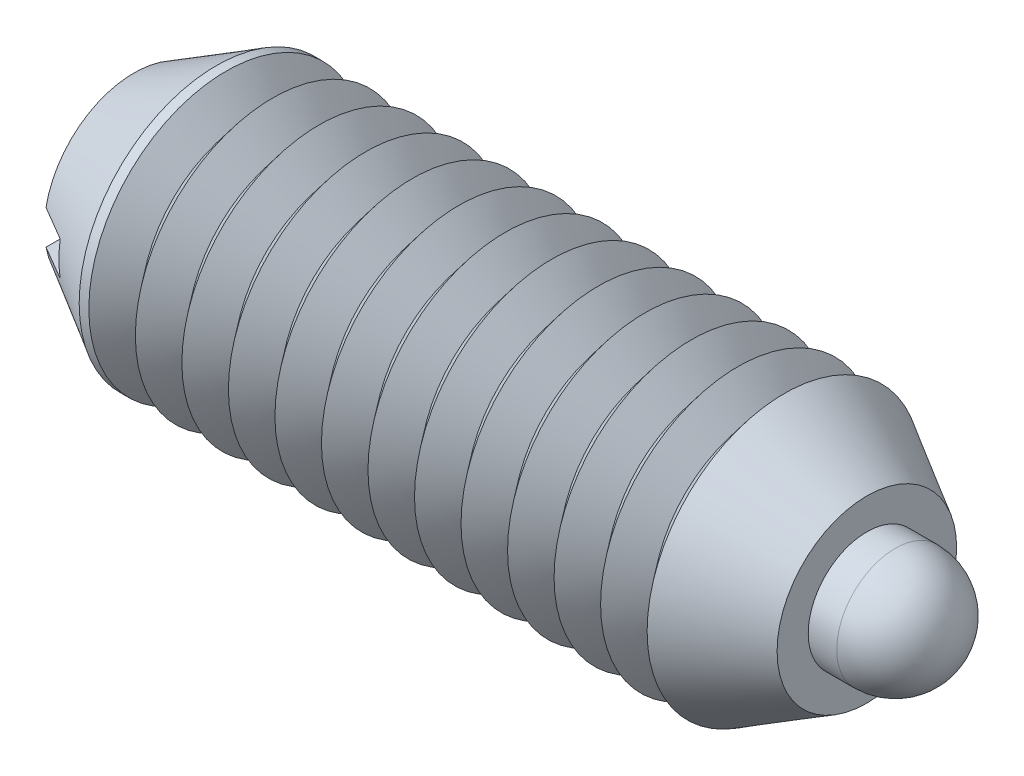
ISO-10303-21;
HEADER;
FILE_DESCRIPTION(('STEP AP214'),'2;1');
FILE_NAME('part.step','',(''),(''),'','','');
FILE_SCHEMA(('AUTOMOTIVE_DESIGN { 1 0 10303 214 1 1 1 1 }'));
ENDSEC;
DATA;
#1=APPLICATION_CONTEXT('core data for automotive mechanical design processes');
#2=APPLICATION_PROTOCOL_DEFINITION('international standard','automotive_design',2000,#1);
#3=PRODUCT_CONTEXT('',#1,'mechanical');
#4=PRODUCT('Part','Part','',(#3));
#5=PRODUCT_RELATED_PRODUCT_CATEGORY('part','',(#4));
#6=PRODUCT_DEFINITION_FORMATION('','',#4);
#7=PRODUCT_DEFINITION_CONTEXT('part definition',#1,'design');
#8=PRODUCT_DEFINITION('design','',#6,#7);
#9=PRODUCT_DEFINITION_SHAPE('','',#8);
#10=(LENGTH_UNIT() NAMED_UNIT(*) SI_UNIT(.MILLI.,.METRE.));
#11=(NAMED_UNIT(*) PLANE_ANGLE_UNIT() SI_UNIT($,.RADIAN.));
#12=(NAMED_UNIT(*) SI_UNIT($,.STERADIAN.) SOLID_ANGLE_UNIT());
#13=UNCERTAINTY_MEASURE_WITH_UNIT(LENGTH_MEASURE(1.E-05),#10,'distance_accuracy_value','');
#14=(GEOMETRIC_REPRESENTATION_CONTEXT(3) GLOBAL_UNCERTAINTY_ASSIGNED_CONTEXT((#13)) GLOBAL_UNIT_ASSIGNED_CONTEXT((#10,
#11,#12)) REPRESENTATION_CONTEXT('',''));
#15=CARTESIAN_POINT('',(0.,0.,0.));
#16=DIRECTION('',(0.,0.,1.));
#17=DIRECTION('',(1.,0.,0.));
#18=AXIS2_PLACEMENT_3D('',#15,#16,#17);
#19=CARTESIAN_POINT('',(9.0678,0.,0.));
#20=DIRECTION('',(-1.,0.,0.));
#21=DIRECTION('',(0.,-0.719424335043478,-0.694570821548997));
#22=AXIS2_PLACEMENT_3D('',#19,#20,#21);
#23=PLANE('',#22);
#24=CARTESIAN_POINT('',(9.0678,0.,0.));
#25=DIRECTION('',(1.,0.,0.));
#26=DIRECTION('',(0.,0.719424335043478,0.694570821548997));
#27=AXIS2_PLACEMENT_3D('',#24,#25,#26);
#28=CIRCLE('',#27,0.889);
#29=CARTESIAN_POINT('',(9.0678,0.639568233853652,0.617473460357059));
#30=VERTEX_POINT('',#29);
#31=EDGE_CURVE('P0_E10',#30,#30,#28,.T.);
#32=ORIENTED_EDGE('',*,*,#31,.F.);
#33=EDGE_LOOP('',(#32));
#34=FACE_BOUND('',#33,.T.);
#35=ADVANCED_FACE('P0_F14',(#34),#23,.T.);
#36=CARTESIAN_POINT('',(9.2456,0.,0.));
#37=DIRECTION('',(1.,0.,0.));
#38=DIRECTION('',(0.,0.719424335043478,0.694570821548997));
#39=AXIS2_PLACEMENT_3D('',#36,#37,#38);
#40=CONICAL_SURFACE('',#39,1.0668,0.78539816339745);
#41=ORIENTED_EDGE('',*,*,#31,.T.);
#42=EDGE_LOOP('',(#41));
#43=FACE_BOUND('',#42,.T.);
#44=CARTESIAN_POINT('',(9.2456,0.,0.));
#45=DIRECTION('',(1.,0.,0.));
#46=DIRECTION('',(0.,0.719424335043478,0.694570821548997));
#47=AXIS2_PLACEMENT_3D('',#44,#45,#46);
#48=CIRCLE('',#47,1.0668);
#49=CARTESIAN_POINT('',(9.2456,0.767481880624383,0.740968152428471));
#50=VERTEX_POINT('',#49);
#51=EDGE_CURVE('P0_E20',#50,#50,#48,.T.);
#52=ORIENTED_EDGE('',*,*,#51,.F.);
#53=EDGE_LOOP('',(#52));
#54=FACE_BOUND('',#53,.T.);
#55=ADVANCED_FACE('P0_F54',(#43,#54),#40,.T.);
#56=CARTESIAN_POINT('',(12.4333,0.,0.));
#57=DIRECTION('',(1.,0.,0.));
#58=DIRECTION('',(0.,0.719424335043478,0.694570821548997));
#59=AXIS2_PLACEMENT_3D('',#56,#57,#58);
#60=CYLINDRICAL_SURFACE('',#59,1.0668);
#61=ORIENTED_EDGE('',*,*,#51,.T.);
#62=EDGE_LOOP('',(#61));
#63=FACE_BOUND('',#62,.T.);
#64=CARTESIAN_POINT('',(10.5378413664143,0.,0.));
#65=DIRECTION('',(1.,0.,0.));
#66=DIRECTION('',(0.,0.719424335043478,0.694570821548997));
#67=AXIS2_PLACEMENT_3D('',#64,#65,#66);
#68=CIRCLE('',#67,1.0668);
#69=CARTESIAN_POINT('',(10.5378413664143,0.767481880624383,0.74096815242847));
#70=VERTEX_POINT('',#69);
#71=EDGE_CURVE('P0_E24',#70,#70,#68,.T.);
#72=ORIENTED_EDGE('',*,*,#71,.F.);
#73=EDGE_LOOP('',(#72));
#74=FACE_BOUND('',#73,.T.);
#75=ADVANCED_FACE('P0_F50',(#63,#74),#60,.T.);
#76=CARTESIAN_POINT('',(10.8458,0.,0.));
#77=DIRECTION('',(-1.,0.,0.));
#78=DIRECTION('',(0.,-0.719424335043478,-0.694570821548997));
#79=AXIS2_PLACEMENT_3D('',#76,#77,#78);
#80=CONICAL_SURFACE('',#79,0.889,0.523598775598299);
#81=ORIENTED_EDGE('',*,*,#71,.T.);
#82=EDGE_LOOP('',(#81));
#83=FACE_BOUND('',#82,.T.);
#84=CARTESIAN_POINT('',(10.8458,0.,0.));
#85=DIRECTION('',(1.,0.,0.));
#86=DIRECTION('',(0.,0.719424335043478,0.694570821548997));
#87=AXIS2_PLACEMENT_3D('',#84,#85,#86);
#88=CIRCLE('',#87,0.889);
#89=CARTESIAN_POINT('',(10.8458,0.639568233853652,0.617473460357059));
#90=VERTEX_POINT('',#89);
#91=EDGE_CURVE('P0_E28',#90,#90,#88,.T.);
#92=ORIENTED_EDGE('',*,*,#91,.F.);
#93=EDGE_LOOP('',(#92));
#94=FACE_BOUND('',#93,.T.);
#95=ADVANCED_FACE('P0_F41',(#83,#94),#80,.T.);
#96=CARTESIAN_POINT('',(12.4333,0.,0.));
#97=DIRECTION('',(1.,0.,0.));
#98=DIRECTION('',(0.,0.719424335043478,0.694570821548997));
#99=AXIS2_PLACEMENT_3D('',#96,#97,#98);
#100=CYLINDRICAL_SURFACE('',#99,0.889);
#101=ORIENTED_EDGE('',*,*,#91,.T.);
#102=EDGE_LOOP('',(#101));
#103=FACE_BOUND('',#102,.T.);
#104=CARTESIAN_POINT('',(11.5443,0.,0.));
#105=DIRECTION('',(1.,0.,0.));
#106=DIRECTION('',(0.,0.719424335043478,0.694570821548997));
#107=AXIS2_PLACEMENT_3D('',#104,#105,#106);
#108=CIRCLE('',#107,0.889);
#109=CARTESIAN_POINT('',(11.5443,0.639568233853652,0.617473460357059));
#110=VERTEX_POINT('',#109);
#111=EDGE_CURVE('P0_E33',#110,#110,#108,.T.);
#112=ORIENTED_EDGE('',*,*,#111,.F.);
#113=EDGE_LOOP('',(#112));
#114=FACE_BOUND('',#113,.T.);
#115=ADVANCED_FACE('P0_F39',(#103,#114),#100,.T.);
#116=CARTESIAN_POINT('',(11.5443,0.,0.));
#117=DIRECTION('',(1.,0.,0.));
#118=DIRECTION('',(0.,-0.719424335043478,-0.694570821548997));
#119=AXIS2_PLACEMENT_3D('',#116,#117,#118);
#120=SPHERICAL_SURFACE('',#119,0.889);
#121=ORIENTED_EDGE('',*,*,#111,.T.);
#122=EDGE_LOOP('',(#121));
#123=FACE_BOUND('',#122,.T.);
#124=ADVANCED_FACE('P0_F37',(#123),#120,.T.);
#125=CLOSED_SHELL('',(#35,#55,#75,#95,#115,#124));
#126=MANIFOLD_SOLID_BREP('P0_B1',#125);
#127=CARTESIAN_POINT('',(11.1125,0.,0.));
#128=DIRECTION('',(1.,0.,0.));
#129=DIRECTION('',(0.,0.,-1.));
#130=AXIS2_PLACEMENT_3D('',#127,#128,#129);
#131=PLANE('',#130);
#132=CARTESIAN_POINT('',(11.1125,0.,0.));
#133=DIRECTION('',(1.,0.,0.));
#134=DIRECTION('',(0.,0.,-1.));
#135=AXIS2_PLACEMENT_3D('',#132,#133,#134);
#136=CIRCLE('',#135,1.36129691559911);
#137=CARTESIAN_POINT('',(11.1125,0.,-1.36129691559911));
#138=VERTEX_POINT('',#137);
#139=EDGE_CURVE('P1_E81',#138,#138,#136,.T.);
#140=ORIENTED_EDGE('',*,*,#139,.T.);
#141=EDGE_LOOP('',(#140));
#142=FACE_BOUND('',#141,.T.);
#143=CARTESIAN_POINT('',(11.1125,0.,0.));
#144=DIRECTION('',(-1.,0.,0.));
#145=DIRECTION('',(0.,0.,1.));
#146=AXIS2_PLACEMENT_3D('',#143,#144,#145);
#147=CIRCLE('',#146,0.889);
#148=CARTESIAN_POINT('',(11.1125,0.,0.889));
#149=VERTEX_POINT('',#148);
#150=EDGE_CURVE('P1_E68',#149,#149,#147,.T.);
#151=ORIENTED_EDGE('',*,*,#150,.T.);
#152=EDGE_LOOP('',(#151));
#153=FACE_BOUND('',#152,.T.);
#154=ADVANCED_FACE('P1_F15',(#142,#153),#131,.T.);
#155=CARTESIAN_POINT('',(11.1125,0.,0.));
#156=DIRECTION('',(-1.,0.,0.));
#157=DIRECTION('',(0.,0.,1.));
#158=AXIS2_PLACEMENT_3D('',#155,#156,#157);
#159=CONICAL_SURFACE('',#158,1.36129691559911,0.523598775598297);
#160=CARTESIAN_POINT('',(9.86281999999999,0.,0.));
#161=DIRECTION('',(-1.,0.,0.));
#162=DIRECTION('',(0.,0.,1.));
#163=AXIS2_PLACEMENT_3D('',#160,#161,#162);
#164=CIRCLE('',#163,2.0828);
#165=CARTESIAN_POINT('',(9.86281999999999,0.,2.0828));
#166=VERTEX_POINT('',#165);
#167=EDGE_CURVE('P1_E193',#166,#166,#164,.T.);
#168=ORIENTED_EDGE('',*,*,#167,.F.);
#169=EDGE_LOOP('',(#168));
#170=FACE_BOUND('',#169,.T.);
#171=ORIENTED_EDGE('',*,*,#139,.F.);
#172=EDGE_LOOP('',(#171));
#173=FACE_BOUND('',#172,.T.);
#174=ADVANCED_FACE('P1_F17',(#170,#173),#159,.T.);
#175=CARTESIAN_POINT('',(0.,0.,0.));
#176=DIRECTION('',(-1.,0.,0.));
#177=DIRECTION('',(0.,0.,1.));
#178=AXIS2_PLACEMENT_3D('',#175,#176,#177);
#179=CYLINDRICAL_SURFACE('',#178,0.889);
#180=CARTESIAN_POINT('',(10.8458,0.,0.));
#181=DIRECTION('',(-1.,0.,0.));
#182=DIRECTION('',(0.,0.,1.));
#183=AXIS2_PLACEMENT_3D('',#180,#181,#182);
#184=CIRCLE('',#183,0.889);
#185=CARTESIAN_POINT('',(10.8458,0.,0.889));
#186=VERTEX_POINT('',#185);
#187=EDGE_CURVE('P1_E205',#186,#186,#184,.T.);
#188=ORIENTED_EDGE('',*,*,#187,.T.);
#189=EDGE_LOOP('',(#188));
#190=FACE_BOUND('',#189,.T.);
#191=ORIENTED_EDGE('',*,*,#150,.F.);
#192=EDGE_LOOP('',(#191));
#193=FACE_BOUND('',#192,.T.);
#194=ADVANCED_FACE('P1_F530',(#190,#193),#179,.F.);
#195=CARTESIAN_POINT('',(10.8458,0.,0.));
#196=DIRECTION('',(-1.,0.,0.));
#197=DIRECTION('',(0.,0.,1.));
#198=AXIS2_PLACEMENT_3D('',#195,#196,#197);
#199=CONICAL_SURFACE('',#198,0.889,0.78539816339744);
#200=CARTESIAN_POINT('',(10.668,0.,0.));
#201=DIRECTION('',(-1.,0.,0.));
#202=DIRECTION('',(0.,0.,1.));
#203=AXIS2_PLACEMENT_3D('',#200,#201,#202);
#204=CIRCLE('',#203,1.0668);
#205=CARTESIAN_POINT('',(10.668,0.,1.0668));
#206=VERTEX_POINT('',#205);
#207=EDGE_CURVE('P1_E202',#206,#206,#204,.T.);
#208=ORIENTED_EDGE('',*,*,#207,.T.);
#209=EDGE_LOOP('',(#208));
#210=FACE_BOUND('',#209,.T.);
#211=ORIENTED_EDGE('',*,*,#187,.F.);
#212=EDGE_LOOP('',(#211));
#213=FACE_BOUND('',#212,.T.);
#214=ADVANCED_FACE('P1_F520',(#210,#213),#199,.F.);
#215=CARTESIAN_POINT('',(0.,0.,0.));
#216=DIRECTION('',(-1.,0.,0.));
#217=DIRECTION('',(0.,0.,1.));
#218=AXIS2_PLACEMENT_3D('',#215,#216,#217);
#219=CYLINDRICAL_SURFACE('',#218,1.0668);
#220=CARTESIAN_POINT('',(1.5621,0.,0.));
#221=DIRECTION('',(-1.,0.,0.));
#222=DIRECTION('',(0.,0.,1.));
#223=AXIS2_PLACEMENT_3D('',#220,#221,#222);
#224=CIRCLE('',#223,1.0668);
#225=CARTESIAN_POINT('',(1.5621,0.,1.0668));
#226=VERTEX_POINT('',#225);
#227=EDGE_CURVE('P1_E199',#226,#226,#224,.T.);
#228=ORIENTED_EDGE('',*,*,#227,.T.);
#229=EDGE_LOOP('',(#228));
#230=FACE_BOUND('',#229,.T.);
#231=ORIENTED_EDGE('',*,*,#207,.F.);
#232=EDGE_LOOP('',(#231));
#233=FACE_BOUND('',#232,.T.);
#234=ADVANCED_FACE('P1_F510',(#230,#233),#219,.F.);
#235=CARTESIAN_POINT('',(1.5621,0.,0.));
#236=DIRECTION('',(1.,0.,0.));
#237=DIRECTION('',(0.,0.,-1.));
#238=AXIS2_PLACEMENT_3D('',#235,#236,#237);
#239=PLANE('',#238);
#240=ORIENTED_EDGE('',*,*,#227,.F.);
#241=EDGE_LOOP('',(#240));
#242=FACE_BOUND('',#241,.T.);
#243=ADVANCED_FACE('P1_F500',(#242),#239,.T.);
#244=CARTESIAN_POINT('',(9.51004222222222,0.,0.));
#245=DIRECTION('',(1.,0.,0.));
#246=DIRECTION('',(0.,0.,-1.));
#247=AXIS2_PLACEMENT_3D('',#244,#245,#246);
#248=CONICAL_SURFACE('',#247,1.64218069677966,0.895664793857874);
#249=ORIENTED_EDGE('',*,*,#167,.T.);
#250=EDGE_LOOP('',(#249));
#251=FACE_BOUND('',#250,.T.);
#252=CARTESIAN_POINT('',(9.51004222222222,0.,0.));
#253=DIRECTION('',(-1.,0.,0.));
#254=DIRECTION('',(0.,0.,1.));
#255=AXIS2_PLACEMENT_3D('',#252,#253,#254);
#256=CIRCLE('',#255,1.64218069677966);
#257=CARTESIAN_POINT('',(9.51004222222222,0.,1.64218069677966));
#258=VERTEX_POINT('',#257);
#259=EDGE_CURVE('P1_E196',#258,#258,#256,.T.);
#260=ORIENTED_EDGE('',*,*,#259,.F.);
#261=EDGE_LOOP('',(#260));
#262=FACE_BOUND('',#261,.T.);
#263=ADVANCED_FACE('P1_F490',(#251,#262),#248,.T.);
#264=CARTESIAN_POINT('',(9.15726444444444,0.,0.));
#265=DIRECTION('',(-1.,0.,0.));
#266=DIRECTION('',(0.,0.,1.));
#267=AXIS2_PLACEMENT_3D('',#264,#265,#266);
#268=CONICAL_SURFACE('',#267,2.0828,0.895664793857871);
#269=ORIENTED_EDGE('',*,*,#259,.T.);
#270=EDGE_LOOP('',(#269));
#271=FACE_BOUND('',#270,.T.);
#272=CARTESIAN_POINT('',(9.15726444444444,0.,0.));
#273=DIRECTION('',(-1.,0.,0.));
#274=DIRECTION('',(0.,0.,1.));
#275=AXIS2_PLACEMENT_3D('',#272,#273,#274);
#276=CIRCLE('',#275,2.0828);
#277=CARTESIAN_POINT('',(9.15726444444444,0.,2.0828));
#278=VERTEX_POINT('',#277);
#279=EDGE_CURVE('P1_E187',#278,#278,#276,.T.);
#280=ORIENTED_EDGE('',*,*,#279,.F.);
#281=EDGE_LOOP('',(#280));
#282=FACE_BOUND('',#281,.T.);
#283=ADVANCED_FACE('P1_F480',(#271,#282),#268,.T.);
#284=CARTESIAN_POINT('',(8.80448666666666,0.,0.));
#285=DIRECTION('',(1.,0.,0.));
#286=DIRECTION('',(0.,0.,-1.));
#287=AXIS2_PLACEMENT_3D('',#284,#285,#286);
#288=CONICAL_SURFACE('',#287,1.64218069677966,0.895664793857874);
#289=ORIENTED_EDGE('',*,*,#279,.T.);
#290=EDGE_LOOP('',(#289));
#291=FACE_BOUND('',#290,.T.);
#292=CARTESIAN_POINT('',(8.80448666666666,0.,0.));
#293=DIRECTION('',(-1.,0.,0.));
#294=DIRECTION('',(0.,0.,1.));
#295=AXIS2_PLACEMENT_3D('',#292,#293,#294);
#296=CIRCLE('',#295,1.64218069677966);
#297=CARTESIAN_POINT('',(8.80448666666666,0.,1.64218069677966));
#298=VERTEX_POINT('',#297);
#299=EDGE_CURVE('P1_E190',#298,#298,#296,.T.);
#300=ORIENTED_EDGE('',*,*,#299,.F.);
#301=EDGE_LOOP('',(#300));
#302=FACE_BOUND('',#301,.T.);
#303=ADVANCED_FACE('P1_F470',(#291,#302),#288,.T.);
#304=CARTESIAN_POINT('',(8.45170888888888,0.,0.));
#305=DIRECTION('',(-1.,0.,0.));
#306=DIRECTION('',(0.,0.,1.));
#307=AXIS2_PLACEMENT_3D('',#304,#305,#306);
#308=CONICAL_SURFACE('',#307,2.0828,0.895664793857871);
#309=ORIENTED_EDGE('',*,*,#299,.T.);
#310=EDGE_LOOP('',(#309));
#311=FACE_BOUND('',#310,.T.);
#312=CARTESIAN_POINT('',(8.45170888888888,0.,0.));
#313=DIRECTION('',(-1.,0.,0.));
#314=DIRECTION('',(0.,0.,1.));
#315=AXIS2_PLACEMENT_3D('',#312,#313,#314);
#316=CIRCLE('',#315,2.0828);
#317=CARTESIAN_POINT('',(8.45170888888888,0.,2.0828));
#318=VERTEX_POINT('',#317);
#319=EDGE_CURVE('P1_E181',#318,#318,#316,.T.);
#320=ORIENTED_EDGE('',*,*,#319,.F.);
#321=EDGE_LOOP('',(#320));
#322=FACE_BOUND('',#321,.T.);
#323=ADVANCED_FACE('P1_F460',(#311,#322),#308,.T.);
#324=CARTESIAN_POINT('',(8.09893111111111,0.,0.));
#325=DIRECTION('',(1.,0.,0.));
#326=DIRECTION('',(0.,0.,-1.));
#327=AXIS2_PLACEMENT_3D('',#324,#325,#326);
#328=CONICAL_SURFACE('',#327,1.64218069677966,0.895664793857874);
#329=ORIENTED_EDGE('',*,*,#319,.T.);
#330=EDGE_LOOP('',(#329));
#331=FACE_BOUND('',#330,.T.);
#332=CARTESIAN_POINT('',(8.09893111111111,0.,0.));
#333=DIRECTION('',(-1.,0.,0.));
#334=DIRECTION('',(0.,0.,1.));
#335=AXIS2_PLACEMENT_3D('',#332,#333,#334);
#336=CIRCLE('',#335,1.64218069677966);
#337=CARTESIAN_POINT('',(8.09893111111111,0.,1.64218069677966));
#338=VERTEX_POINT('',#337);
#339=EDGE_CURVE('P1_E184',#338,#338,#336,.T.);
#340=ORIENTED_EDGE('',*,*,#339,.F.);
#341=EDGE_LOOP('',(#340));
#342=FACE_BOUND('',#341,.T.);
#343=ADVANCED_FACE('P1_F450',(#331,#342),#328,.T.);
#344=CARTESIAN_POINT('',(7.74615333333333,0.,0.));
#345=DIRECTION('',(-1.,0.,0.));
#346=DIRECTION('',(0.,0.,1.));
#347=AXIS2_PLACEMENT_3D('',#344,#345,#346);
#348=CONICAL_SURFACE('',#347,2.0828,0.895664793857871);
#349=ORIENTED_EDGE('',*,*,#339,.T.);
#350=EDGE_LOOP('',(#349));
#351=FACE_BOUND('',#350,.T.);
#352=CARTESIAN_POINT('',(7.74615333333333,0.,0.));
#353=DIRECTION('',(-1.,0.,0.));
#354=DIRECTION('',(0.,0.,1.));
#355=AXIS2_PLACEMENT_3D('',#352,#353,#354);
#356=CIRCLE('',#355,2.0828);
#357=CARTESIAN_POINT('',(7.74615333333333,0.,2.0828));
#358=VERTEX_POINT('',#357);
#359=EDGE_CURVE('P1_E175',#358,#358,#356,.T.);
#360=ORIENTED_EDGE('',*,*,#359,.F.);
#361=EDGE_LOOP('',(#360));
#362=FACE_BOUND('',#361,.T.);
#363=ADVANCED_FACE('P1_F440',(#351,#362),#348,.T.);
#364=CARTESIAN_POINT('',(7.39337555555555,0.,0.));
#365=DIRECTION('',(1.,0.,0.));
#366=DIRECTION('',(0.,0.,-1.));
#367=AXIS2_PLACEMENT_3D('',#364,#365,#366);
#368=CONICAL_SURFACE('',#367,1.64218069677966,0.895664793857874);
#369=ORIENTED_EDGE('',*,*,#359,.T.);
#370=EDGE_LOOP('',(#369));
#371=FACE_BOUND('',#370,.T.);
#372=CARTESIAN_POINT('',(7.39337555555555,0.,0.));
#373=DIRECTION('',(-1.,0.,0.));
#374=DIRECTION('',(0.,0.,1.));
#375=AXIS2_PLACEMENT_3D('',#372,#373,#374);
#376=CIRCLE('',#375,1.64218069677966);
#377=CARTESIAN_POINT('',(7.39337555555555,0.,1.64218069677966));
#378=VERTEX_POINT('',#377);
#379=EDGE_CURVE('P1_E178',#378,#378,#376,.T.);
#380=ORIENTED_EDGE('',*,*,#379,.F.);
#381=EDGE_LOOP('',(#380));
#382=FACE_BOUND('',#381,.T.);
#383=ADVANCED_FACE('P1_F430',(#371,#382),#368,.T.);
#384=CARTESIAN_POINT('',(7.04059777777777,0.,0.));
#385=DIRECTION('',(-1.,0.,0.));
#386=DIRECTION('',(0.,0.,1.));
#387=AXIS2_PLACEMENT_3D('',#384,#385,#386);
#388=CONICAL_SURFACE('',#387,2.0828,0.895664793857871);
#389=ORIENTED_EDGE('',*,*,#379,.T.);
#390=EDGE_LOOP('',(#389));
#391=FACE_BOUND('',#390,.T.);
#392=CARTESIAN_POINT('',(7.04059777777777,0.,0.));
#393=DIRECTION('',(-1.,0.,0.));
#394=DIRECTION('',(0.,0.,1.));
#395=AXIS2_PLACEMENT_3D('',#392,#393,#394);
#396=CIRCLE('',#395,2.0828);
#397=CARTESIAN_POINT('',(7.04059777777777,0.,2.0828));
#398=VERTEX_POINT('',#397);
#399=EDGE_CURVE('P1_E169',#398,#398,#396,.T.);
#400=ORIENTED_EDGE('',*,*,#399,.F.);
#401=EDGE_LOOP('',(#400));
#402=FACE_BOUND('',#401,.T.);
#403=ADVANCED_FACE('P1_F420',(#391,#402),#388,.T.);
#404=CARTESIAN_POINT('',(6.68781999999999,0.,0.));
#405=DIRECTION('',(1.,0.,0.));
#406=DIRECTION('',(0.,0.,-1.));
#407=AXIS2_PLACEMENT_3D('',#404,#405,#406);
#408=CONICAL_SURFACE('',#407,1.64218069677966,0.895664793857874);
#409=ORIENTED_EDGE('',*,*,#399,.T.);
#410=EDGE_LOOP('',(#409));
#411=FACE_BOUND('',#410,.T.);
#412=CARTESIAN_POINT('',(6.68781999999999,0.,0.));
#413=DIRECTION('',(-1.,0.,0.));
#414=DIRECTION('',(0.,0.,1.));
#415=AXIS2_PLACEMENT_3D('',#412,#413,#414);
#416=CIRCLE('',#415,1.64218069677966);
#417=CARTESIAN_POINT('',(6.68781999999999,0.,1.64218069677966));
#418=VERTEX_POINT('',#417);
#419=EDGE_CURVE('P1_E172',#418,#418,#416,.T.);
#420=ORIENTED_EDGE('',*,*,#419,.F.);
#421=EDGE_LOOP('',(#420));
#422=FACE_BOUND('',#421,.T.);
#423=ADVANCED_FACE('P1_F410',(#411,#422),#408,.T.);
#424=CARTESIAN_POINT('',(6.33504222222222,0.,0.));
#425=DIRECTION('',(-1.,0.,0.));
#426=DIRECTION('',(0.,0.,1.));
#427=AXIS2_PLACEMENT_3D('',#424,#425,#426);
#428=CONICAL_SURFACE('',#427,2.0828,0.895664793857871);
#429=ORIENTED_EDGE('',*,*,#419,.T.);
#430=EDGE_LOOP('',(#429));
#431=FACE_BOUND('',#430,.T.);
#432=CARTESIAN_POINT('',(6.33504222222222,0.,0.));
#433=DIRECTION('',(-1.,0.,0.));
#434=DIRECTION('',(0.,0.,1.));
#435=AXIS2_PLACEMENT_3D('',#432,#433,#434);
#436=CIRCLE('',#435,2.0828);
#437=CARTESIAN_POINT('',(6.33504222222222,0.,2.0828));
#438=VERTEX_POINT('',#437);
#439=EDGE_CURVE('P1_E163',#438,#438,#436,.T.);
#440=ORIENTED_EDGE('',*,*,#439,.F.);
#441=EDGE_LOOP('',(#440));
#442=FACE_BOUND('',#441,.T.);
#443=ADVANCED_FACE('P1_F400',(#431,#442),#428,.T.);
#444=CARTESIAN_POINT('',(5.98226444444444,0.,0.));
#445=DIRECTION('',(1.,0.,0.));
#446=DIRECTION('',(0.,0.,-1.));
#447=AXIS2_PLACEMENT_3D('',#444,#445,#446);
#448=CONICAL_SURFACE('',#447,1.64218069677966,0.895664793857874);
#449=ORIENTED_EDGE('',*,*,#439,.T.);
#450=EDGE_LOOP('',(#449));
#451=FACE_BOUND('',#450,.T.);
#452=CARTESIAN_POINT('',(5.98226444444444,0.,0.));
#453=DIRECTION('',(-1.,0.,0.));
#454=DIRECTION('',(0.,0.,1.));
#455=AXIS2_PLACEMENT_3D('',#452,#453,#454);
#456=CIRCLE('',#455,1.64218069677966);
#457=CARTESIAN_POINT('',(5.98226444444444,0.,1.64218069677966));
#458=VERTEX_POINT('',#457);
#459=EDGE_CURVE('P1_E166',#458,#458,#456,.T.);
#460=ORIENTED_EDGE('',*,*,#459,.F.);
#461=EDGE_LOOP('',(#460));
#462=FACE_BOUND('',#461,.T.);
#463=ADVANCED_FACE('P1_F390',(#451,#462),#448,.T.);
#464=CARTESIAN_POINT('',(5.62948666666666,0.,0.));
#465=DIRECTION('',(-1.,0.,0.));
#466=DIRECTION('',(0.,0.,1.));
#467=AXIS2_PLACEMENT_3D('',#464,#465,#466);
#468=CONICAL_SURFACE('',#467,2.0828,0.895664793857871);
#469=ORIENTED_EDGE('',*,*,#459,.T.);
#470=EDGE_LOOP('',(#469));
#471=FACE_BOUND('',#470,.T.);
#472=CARTESIAN_POINT('',(5.62948666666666,0.,0.));
#473=DIRECTION('',(-1.,0.,0.));
#474=DIRECTION('',(0.,0.,1.));
#475=AXIS2_PLACEMENT_3D('',#472,#473,#474);
#476=CIRCLE('',#475,2.0828);
#477=CARTESIAN_POINT('',(5.62948666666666,0.,2.0828));
#478=VERTEX_POINT('',#477);
#479=EDGE_CURVE('P1_E157',#478,#478,#476,.T.);
#480=ORIENTED_EDGE('',*,*,#479,.F.);
#481=EDGE_LOOP('',(#480));
#482=FACE_BOUND('',#481,.T.);
#483=ADVANCED_FACE('P1_F380',(#471,#482),#468,.T.);
#484=CARTESIAN_POINT('',(5.27670888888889,0.,0.));
#485=DIRECTION('',(1.,0.,0.));
#486=DIRECTION('',(0.,0.,-1.));
#487=AXIS2_PLACEMENT_3D('',#484,#485,#486);
#488=CONICAL_SURFACE('',#487,1.64218069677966,0.895664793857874);
#489=ORIENTED_EDGE('',*,*,#479,.T.);
#490=EDGE_LOOP('',(#489));
#491=FACE_BOUND('',#490,.T.);
#492=CARTESIAN_POINT('',(5.27670888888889,0.,0.));
#493=DIRECTION('',(-1.,0.,0.));
#494=DIRECTION('',(0.,0.,1.));
#495=AXIS2_PLACEMENT_3D('',#492,#493,#494);
#496=CIRCLE('',#495,1.64218069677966);
#497=CARTESIAN_POINT('',(5.27670888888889,0.,1.64218069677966));
#498=VERTEX_POINT('',#497);
#499=EDGE_CURVE('P1_E160',#498,#498,#496,.T.);
#500=ORIENTED_EDGE('',*,*,#499,.F.);
#501=EDGE_LOOP('',(#500));
#502=FACE_BOUND('',#501,.T.);
#503=ADVANCED_FACE('P1_F370',(#491,#502),#488,.T.);
#504=CARTESIAN_POINT('',(4.92393111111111,0.,0.));
#505=DIRECTION('',(-1.,0.,0.));
#506=DIRECTION('',(0.,0.,1.));
#507=AXIS2_PLACEMENT_3D('',#504,#505,#506);
#508=CONICAL_SURFACE('',#507,2.0828,0.895664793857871);
#509=ORIENTED_EDGE('',*,*,#499,.T.);
#510=EDGE_LOOP('',(#509));
#511=FACE_BOUND('',#510,.T.);
#512=CARTESIAN_POINT('',(4.92393111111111,0.,0.));
#513=DIRECTION('',(-1.,0.,0.));
#514=DIRECTION('',(0.,0.,1.));
#515=AXIS2_PLACEMENT_3D('',#512,#513,#514);
#516=CIRCLE('',#515,2.0828);
#517=CARTESIAN_POINT('',(4.92393111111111,0.,2.0828));
#518=VERTEX_POINT('',#517);
#519=EDGE_CURVE('P1_E151',#518,#518,#516,.T.);
#520=ORIENTED_EDGE('',*,*,#519,.F.);
#521=EDGE_LOOP('',(#520));
#522=FACE_BOUND('',#521,.T.);
#523=ADVANCED_FACE('P1_F360',(#511,#522),#508,.T.);
#524=CARTESIAN_POINT('',(4.57115333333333,0.,0.));
#525=DIRECTION('',(1.,0.,0.));
#526=DIRECTION('',(0.,0.,-1.));
#527=AXIS2_PLACEMENT_3D('',#524,#525,#526);
#528=CONICAL_SURFACE('',#527,1.64218069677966,0.895664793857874);
#529=ORIENTED_EDGE('',*,*,#519,.T.);
#530=EDGE_LOOP('',(#529));
#531=FACE_BOUND('',#530,.T.);
#532=CARTESIAN_POINT('',(4.57115333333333,0.,0.));
#533=DIRECTION('',(-1.,0.,0.));
#534=DIRECTION('',(0.,0.,1.));
#535=AXIS2_PLACEMENT_3D('',#532,#533,#534);
#536=CIRCLE('',#535,1.64218069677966);
#537=CARTESIAN_POINT('',(4.57115333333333,0.,1.64218069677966));
#538=VERTEX_POINT('',#537);
#539=EDGE_CURVE('P1_E154',#538,#538,#536,.T.);
#540=ORIENTED_EDGE('',*,*,#539,.F.);
#541=EDGE_LOOP('',(#540));
#542=FACE_BOUND('',#541,.T.);
#543=ADVANCED_FACE('P1_F350',(#531,#542),#528,.T.);
#544=CARTESIAN_POINT('',(4.21837555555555,0.,0.));
#545=DIRECTION('',(-1.,0.,0.));
#546=DIRECTION('',(0.,0.,1.));
#547=AXIS2_PLACEMENT_3D('',#544,#545,#546);
#548=CONICAL_SURFACE('',#547,2.0828,0.895664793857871);
#549=ORIENTED_EDGE('',*,*,#539,.T.);
#550=EDGE_LOOP('',(#549));
#551=FACE_BOUND('',#550,.T.);
#552=CARTESIAN_POINT('',(4.21837555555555,0.,0.));
#553=DIRECTION('',(-1.,0.,0.));
#554=DIRECTION('',(0.,0.,1.));
#555=AXIS2_PLACEMENT_3D('',#552,#553,#554);
#556=CIRCLE('',#555,2.0828);
#557=CARTESIAN_POINT('',(4.21837555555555,0.,2.0828));
#558=VERTEX_POINT('',#557);
#559=EDGE_CURVE('P1_E145',#558,#558,#556,.T.);
#560=ORIENTED_EDGE('',*,*,#559,.F.);
#561=EDGE_LOOP('',(#560));
#562=FACE_BOUND('',#561,.T.);
#563=ADVANCED_FACE('P1_F340',(#551,#562),#548,.T.);
#564=CARTESIAN_POINT('',(3.86559777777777,0.,0.));
#565=DIRECTION('',(1.,0.,0.));
#566=DIRECTION('',(0.,0.,-1.));
#567=AXIS2_PLACEMENT_3D('',#564,#565,#566);
#568=CONICAL_SURFACE('',#567,1.64218069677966,0.895664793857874);
#569=ORIENTED_EDGE('',*,*,#559,.T.);
#570=EDGE_LOOP('',(#569));
#571=FACE_BOUND('',#570,.T.);
#572=CARTESIAN_POINT('',(3.86559777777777,0.,0.));
#573=DIRECTION('',(-1.,0.,0.));
#574=DIRECTION('',(0.,0.,1.));
#575=AXIS2_PLACEMENT_3D('',#572,#573,#574);
#576=CIRCLE('',#575,1.64218069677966);
#577=CARTESIAN_POINT('',(3.86559777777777,0.,1.64218069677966));
#578=VERTEX_POINT('',#577);
#579=EDGE_CURVE('P1_E148',#578,#578,#576,.T.);
#580=ORIENTED_EDGE('',*,*,#579,.F.);
#581=EDGE_LOOP('',(#580));
#582=FACE_BOUND('',#581,.T.);
#583=ADVANCED_FACE('P1_F330',(#571,#582),#568,.T.);
#584=CARTESIAN_POINT('',(3.51282,0.,0.));
#585=DIRECTION('',(-1.,0.,0.));
#586=DIRECTION('',(0.,0.,1.));
#587=AXIS2_PLACEMENT_3D('',#584,#585,#586);
#588=CONICAL_SURFACE('',#587,2.0828,0.895664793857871);
#589=ORIENTED_EDGE('',*,*,#579,.T.);
#590=EDGE_LOOP('',(#589));
#591=FACE_BOUND('',#590,.T.);
#592=CARTESIAN_POINT('',(3.51281999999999,0.,0.));
#593=DIRECTION('',(-1.,0.,0.));
#594=DIRECTION('',(0.,0.,1.));
#595=AXIS2_PLACEMENT_3D('',#592,#593,#594);
#596=CIRCLE('',#595,2.0828);
#597=CARTESIAN_POINT('',(3.51281999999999,0.,2.0828));
#598=VERTEX_POINT('',#597);
#599=EDGE_CURVE('P1_E139',#598,#598,#596,.T.);
#600=ORIENTED_EDGE('',*,*,#599,.F.);
#601=EDGE_LOOP('',(#600));
#602=FACE_BOUND('',#601,.T.);
#603=ADVANCED_FACE('P1_F320',(#591,#602),#588,.T.);
#604=CARTESIAN_POINT('',(3.16004222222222,0.,0.));
#605=DIRECTION('',(1.,0.,0.));
#606=DIRECTION('',(0.,0.,-1.));
#607=AXIS2_PLACEMENT_3D('',#604,#605,#606);
#608=CONICAL_SURFACE('',#607,1.64218069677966,0.895664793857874);
#609=ORIENTED_EDGE('',*,*,#599,.T.);
#610=EDGE_LOOP('',(#609));
#611=FACE_BOUND('',#610,.T.);
#612=CARTESIAN_POINT('',(3.16004222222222,0.,0.));
#613=DIRECTION('',(-1.,0.,0.));
#614=DIRECTION('',(0.,0.,1.));
#615=AXIS2_PLACEMENT_3D('',#612,#613,#614);
#616=CIRCLE('',#615,1.64218069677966);
#617=CARTESIAN_POINT('',(3.16004222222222,0.,1.64218069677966));
#618=VERTEX_POINT('',#617);
#619=EDGE_CURVE('P1_E142',#618,#618,#616,.T.);
#620=ORIENTED_EDGE('',*,*,#619,.F.);
#621=EDGE_LOOP('',(#620));
#622=FACE_BOUND('',#621,.T.);
#623=ADVANCED_FACE('P1_F310',(#611,#622),#608,.T.);
#624=CARTESIAN_POINT('',(2.80726444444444,0.,0.));
#625=DIRECTION('',(-1.,0.,0.));
#626=DIRECTION('',(0.,0.,1.));
#627=AXIS2_PLACEMENT_3D('',#624,#625,#626);
#628=CONICAL_SURFACE('',#627,2.0828,0.895664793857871);
#629=ORIENTED_EDGE('',*,*,#619,.T.);
#630=EDGE_LOOP('',(#629));
#631=FACE_BOUND('',#630,.T.);
#632=CARTESIAN_POINT('',(2.80726444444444,0.,0.));
#633=DIRECTION('',(-1.,0.,0.));
#634=DIRECTION('',(0.,0.,1.));
#635=AXIS2_PLACEMENT_3D('',#632,#633,#634);
#636=CIRCLE('',#635,2.0828);
#637=CARTESIAN_POINT('',(2.80726444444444,0.,2.0828));
#638=VERTEX_POINT('',#637);
#639=EDGE_CURVE('P1_E129',#638,#638,#636,.T.);
#640=ORIENTED_EDGE('',*,*,#639,.F.);
#641=EDGE_LOOP('',(#640));
#642=FACE_BOUND('',#641,.T.);
#643=ADVANCED_FACE('P1_F300',(#631,#642),#628,.T.);
#644=CARTESIAN_POINT('',(2.45448666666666,0.,0.));
#645=DIRECTION('',(1.,0.,0.));
#646=DIRECTION('',(0.,0.,-1.));
#647=AXIS2_PLACEMENT_3D('',#644,#645,#646);
#648=CONICAL_SURFACE('',#647,1.64218069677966,0.895664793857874);
#649=ORIENTED_EDGE('',*,*,#639,.T.);
#650=EDGE_LOOP('',(#649));
#651=FACE_BOUND('',#650,.T.);
#652=CARTESIAN_POINT('',(2.45448666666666,0.,0.));
#653=DIRECTION('',(-1.,0.,0.));
#654=DIRECTION('',(0.,0.,1.));
#655=AXIS2_PLACEMENT_3D('',#652,#653,#654);
#656=CIRCLE('',#655,1.64218069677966);
#657=CARTESIAN_POINT('',(2.45448666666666,0.,1.64218069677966));
#658=VERTEX_POINT('',#657);
#659=EDGE_CURVE('P1_E136',#658,#658,#656,.T.);
#660=ORIENTED_EDGE('',*,*,#659,.F.);
#661=EDGE_LOOP('',(#660));
#662=FACE_BOUND('',#661,.T.);
#663=ADVANCED_FACE('P1_F290',(#651,#662),#648,.T.);
#664=CARTESIAN_POINT('',(2.10170888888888,0.,0.));
#665=DIRECTION('',(-1.,0.,0.));
#666=DIRECTION('',(0.,0.,1.));
#667=AXIS2_PLACEMENT_3D('',#664,#665,#666);
#668=CONICAL_SURFACE('',#667,2.0828,0.895664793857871);
#669=ORIENTED_EDGE('',*,*,#659,.T.);
#670=EDGE_LOOP('',(#669));
#671=FACE_BOUND('',#670,.T.);
#672=CARTESIAN_POINT('',(2.10170888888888,0.,0.));
#673=DIRECTION('',(-1.,0.,0.));
#674=DIRECTION('',(0.,0.,1.));
#675=AXIS2_PLACEMENT_3D('',#672,#673,#674);
#676=CIRCLE('',#675,2.0828);
#677=CARTESIAN_POINT('',(2.10170888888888,0.,2.0828));
#678=VERTEX_POINT('',#677);
#679=EDGE_CURVE('P1_E126',#678,#678,#676,.T.);
#680=ORIENTED_EDGE('',*,*,#679,.F.);
#681=EDGE_LOOP('',(#680));
#682=FACE_BOUND('',#681,.T.);
#683=ADVANCED_FACE('P1_F280',(#671,#682),#668,.T.);
#684=CARTESIAN_POINT('',(1.74893111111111,0.,0.));
#685=DIRECTION('',(1.,0.,0.));
#686=DIRECTION('',(0.,0.,-1.));
#687=AXIS2_PLACEMENT_3D('',#684,#685,#686);
#688=CONICAL_SURFACE('',#687,1.64218069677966,0.895664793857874);
#689=ORIENTED_EDGE('',*,*,#679,.T.);
#690=EDGE_LOOP('',(#689));
#691=FACE_BOUND('',#690,.T.);
#692=CARTESIAN_POINT('',(1.74893111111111,0.,0.));
#693=DIRECTION('',(-1.,0.,0.));
#694=DIRECTION('',(0.,0.,1.));
#695=AXIS2_PLACEMENT_3D('',#692,#693,#694);
#696=CIRCLE('',#695,1.64218069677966);
#697=CARTESIAN_POINT('',(1.74893111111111,0.,1.64218069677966));
#698=VERTEX_POINT('',#697);
#699=EDGE_CURVE('P1_E125',#698,#698,#696,.T.);
#700=ORIENTED_EDGE('',*,*,#699,.F.);
#701=EDGE_LOOP('',(#700));
#702=FACE_BOUND('',#701,.T.);
#703=ADVANCED_FACE('P1_F270',(#691,#702),#688,.T.);
#704=CARTESIAN_POINT('',(1.39615333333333,0.,0.));
#705=DIRECTION('',(-1.,0.,0.));
#706=DIRECTION('',(0.,0.,1.));
#707=AXIS2_PLACEMENT_3D('',#704,#705,#706);
#708=CONICAL_SURFACE('',#707,2.0828,0.895664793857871);
#709=ORIENTED_EDGE('',*,*,#699,.T.);
#710=EDGE_LOOP('',(#709));
#711=FACE_BOUND('',#710,.T.);
#712=CARTESIAN_POINT('',(1.39615333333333,0.,0.));
#713=DIRECTION('',(-1.,0.,0.));
#714=DIRECTION('',(0.,0.,1.));
#715=AXIS2_PLACEMENT_3D('',#712,#713,#714);
#716=CIRCLE('',#715,2.0828);
#717=CARTESIAN_POINT('',(1.39615333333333,0.,2.0828));
#718=VERTEX_POINT('',#717);
#719=EDGE_CURVE('P1_E123',#718,#718,#716,.T.);
#720=ORIENTED_EDGE('',*,*,#719,.F.);
#721=EDGE_LOOP('',(#720));
#722=FACE_BOUND('',#721,.T.);
#723=ADVANCED_FACE('P1_F110',(#711,#722),#708,.T.);
#724=CARTESIAN_POINT('',(0.,0.,0.));
#725=DIRECTION('',(1.,0.,0.));
#726=DIRECTION('',(0.,0.,-1.));
#727=AXIS2_PLACEMENT_3D('',#724,#725,#726);
#728=PLANE('',#727);
#729=CARTESIAN_POINT('',(0.,0.,0.));
#730=DIRECTION('',(1.,0.,0.));
#731=DIRECTION('',(0.,0.,-1.));
#732=AXIS2_PLACEMENT_3D('',#729,#730,#731);
#733=CIRCLE('',#732,1.36129691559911);
#734=CARTESIAN_POINT('',(0.,-0.26035,-1.33616884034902));
#735=VERTEX_POINT('',#734);
#736=CARTESIAN_POINT('',(0.,-0.26035,1.33616884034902));
#737=VERTEX_POINT('',#736);
#738=EDGE_CURVE('P1_E77',#735,#737,#733,.F.);
#739=ORIENTED_EDGE('',*,*,#738,.T.);
#740=DIRECTION('',(0.,0.,1.));
#741=VECTOR('',#740,1.);
#742=CARTESIAN_POINT('',(0.,-0.26035,-2.0828));
#743=LINE('',#742,#741);
#744=EDGE_CURVE('P1_E35',#735,#737,#743,.T.);
#745=ORIENTED_EDGE('',*,*,#744,.F.);
#746=EDGE_LOOP('',(#739,#745));
#747=FACE_BOUND('',#746,.T.);
#748=ADVANCED_FACE('P1_F101',(#747),#728,.F.);
#749=CARTESIAN_POINT('',(0.,-0.26035,-2.0828));
#750=DIRECTION('',(0.,-1.,0.));
#751=DIRECTION('',(0.,0.,-1.));
#752=AXIS2_PLACEMENT_3D('',#749,#750,#751);
#753=PLANE('',#752);
#754=CARTESIAN_POINT('',(3.03971056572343,-0.26035,-3.10538007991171));
#755=CARTESIAN_POINT('',(2.73619356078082,-0.26035,-2.9295030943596));
#756=CARTESIAN_POINT('',(2.43269972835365,-0.26035,-2.75358610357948));
#757=CARTESIAN_POINT('',(1.82581746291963,-0.26035,-2.40143298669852));
#758=CARTESIAN_POINT('',(1.52242906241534,-0.26035,-2.22519680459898));
#759=CARTESIAN_POINT('',(0.923841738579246,-0.26035,-1.87683600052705));
#760=CARTESIAN_POINT('',(0.628635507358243,-0.26035,-1.70472396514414));
#761=CARTESIAN_POINT('',(0.186359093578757,-0.26035,-1.44570325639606));
#762=CARTESIAN_POINT('',(0.0390349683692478,-0.26035,-1.35922831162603));
#763=CARTESIAN_POINT('',(-0.255316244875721,-0.26035,-1.18577470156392));
#764=CARTESIAN_POINT('',(-0.402343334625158,-0.26035,-1.0987960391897));
#765=CARTESIAN_POINT('',(-0.622839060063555,-0.26035,-0.967335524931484));
#766=CARTESIAN_POINT('',(-0.696530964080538,-0.26035,-0.923228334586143));
#767=CARTESIAN_POINT('',(-0.843706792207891,-0.26035,-0.834610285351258));
#768=CARTESIAN_POINT('',(-0.91719063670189,-0.26035,-0.790099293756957));
#769=CARTESIAN_POINT('',(-1.06453357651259,-0.26035,-0.699987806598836));
#770=CARTESIAN_POINT('',(-1.13838868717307,-0.26035,-0.654380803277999));
#771=CARTESIAN_POINT('',(-1.28534608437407,-0.26035,-0.562114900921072));
#772=CARTESIAN_POINT('',(-1.35844905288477,-0.26035,-0.51545710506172));
#773=CARTESIAN_POINT('',(-1.46699058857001,-0.26035,-0.44371439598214));
#774=CARTESIAN_POINT('',(-1.50300072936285,-0.26035,-0.419496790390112));
#775=CARTESIAN_POINT('',(-1.57449047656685,-0.26035,-0.370070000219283));
#776=CARTESIAN_POINT('',(-1.60996835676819,-0.26035,-0.344858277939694));
#777=CARTESIAN_POINT('',(-1.66212735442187,-0.26035,-0.305972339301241));
#778=CARTESIAN_POINT('',(-1.67925518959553,-0.26035,-0.292899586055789));
#779=CARTESIAN_POINT('',(-1.71308292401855,-0.26035,-0.266214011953));
#780=CARTESIAN_POINT('',(-1.72978291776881,-0.26035,-0.252601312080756));
#781=CARTESIAN_POINT('',(-1.76246737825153,-0.26035,-0.224673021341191));
#782=CARTESIAN_POINT('',(-1.77845456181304,-0.26035,-0.210360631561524));
#783=CARTESIAN_POINT('',(-1.8093682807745,-0.26035,-0.180644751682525));
#784=CARTESIAN_POINT('',(-1.82429647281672,-0.26035,-0.165243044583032));
#785=CARTESIAN_POINT('',(-1.84830527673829,-0.26035,-0.137332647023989));
#786=CARTESIAN_POINT('',(-1.85784954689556,-0.26035,-0.12522888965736));
#787=CARTESIAN_POINT('',(-1.87526950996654,-0.26035,-0.0998803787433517));
#788=CARTESIAN_POINT('',(-1.88315152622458,-0.26035,-0.0866402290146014));
#789=CARTESIAN_POINT('',(-1.89362009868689,-0.26035,-0.0641663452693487));
#790=CARTESIAN_POINT('',(-1.89707777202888,-0.26035,-0.0553472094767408));
#791=CARTESIAN_POINT('',(-1.90255870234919,-0.26035,-0.0372693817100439));
#792=CARTESIAN_POINT('',(-1.90458387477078,-0.26035,-0.0280112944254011));
#793=CARTESIAN_POINT('',(-1.90690933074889,-0.26035,-0.0091896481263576));
#794=CARTESIAN_POINT('',(-1.90719465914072,-0.26035,0.000375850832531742));
#795=CARTESIAN_POINT('',(-1.90594810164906,-0.26035,0.0193849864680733));
#796=CARTESIAN_POINT('',(-1.904415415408,-0.26035,0.0288285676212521));
#797=CARTESIAN_POINT('',(-1.89930080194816,-0.26035,0.0492465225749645));
#798=CARTESIAN_POINT('',(-1.89535686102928,-0.26035,0.0601271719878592));
#799=CARTESIAN_POINT('',(-1.88583002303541,-0.26035,0.0811465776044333));
#800=CARTESIAN_POINT('',(-1.88024216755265,-0.26035,0.0912829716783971));
#801=CARTESIAN_POINT('',(-1.86616017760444,-0.26035,0.113752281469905));
#802=CARTESIAN_POINT('',(-1.85729534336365,-0.26035,0.12584751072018));
#803=CARTESIAN_POINT('',(-1.83844868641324,-0.26035,0.14914656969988));
#804=CARTESIAN_POINT('',(-1.8284644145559,-0.26035,0.160348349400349));
#805=CARTESIAN_POINT('',(-1.80771838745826,-0.26035,0.182146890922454));
#806=CARTESIAN_POINT('',(-1.79695173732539,-0.26035,0.192738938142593));
#807=CARTESIAN_POINT('',(-1.77494825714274,-0.26035,0.213391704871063));
#808=CARTESIAN_POINT('',(-1.76371196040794,-0.26035,0.223452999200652));
#809=CARTESIAN_POINT('',(-1.72699655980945,-0.26035,0.255225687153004));
#810=CARTESIAN_POINT('',(-1.70086338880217,-0.26035,0.276176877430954));
#811=CARTESIAN_POINT('',(-1.64774249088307,-0.26035,0.316973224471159));
#812=CARTESIAN_POINT('',(-1.6207542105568,-0.26035,0.336817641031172));
#813=CARTESIAN_POINT('',(-1.56621112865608,-0.26035,0.375819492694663));
#814=CARTESIAN_POINT('',(-1.53865536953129,-0.26035,0.394975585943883));
#815=CARTESIAN_POINT('',(-1.48320590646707,-0.26035,0.43279358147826));
#816=CARTESIAN_POINT('',(-1.45531217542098,-0.26035,0.451455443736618));
#817=CARTESIAN_POINT('',(-1.37141571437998,-0.26035,0.506836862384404));
#818=CARTESIAN_POINT('',(-1.3150724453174,-0.26035,0.543039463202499));
#819=CARTESIAN_POINT('',(-1.20196774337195,-0.26035,0.614629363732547));
#820=CARTESIAN_POINT('',(-1.14520688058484,-0.26035,0.650017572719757));
#821=CARTESIAN_POINT('',(-0.975156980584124,-0.26035,0.755060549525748));
#822=CARTESIAN_POINT('',(-0.861438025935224,-0.26035,0.824018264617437));
#823=CARTESIAN_POINT('',(-0.633489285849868,-0.26035,0.961087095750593));
#824=CARTESIAN_POINT('',(-0.51925948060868,-0.26035,1.02919817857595));
#825=CARTESIAN_POINT('',(-0.290453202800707,-0.26035,1.16497012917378));
#826=CARTESIAN_POINT('',(-0.175876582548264,-0.26035,1.23263074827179));
#827=CARTESIAN_POINT('',(0.0534476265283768,-0.26035,1.36765677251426));
#828=CARTESIAN_POINT('',(0.168195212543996,-0.26035,1.43502218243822));
#829=CARTESIAN_POINT('',(0.512461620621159,-0.26035,1.63675212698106));
#830=CARTESIAN_POINT('',(0.742145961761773,-0.26035,1.77083413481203));
#831=CARTESIAN_POINT('',(1.20169275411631,-0.26035,2.03861386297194));
#832=CARTESIAN_POINT('',(1.43155517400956,-0.26035,2.17231163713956));
#833=CARTESIAN_POINT('',(1.77626909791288,-0.26035,2.37259626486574));
#834=CARTESIAN_POINT('',(1.89107369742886,-0.26035,2.43926383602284));
#835=CARTESIAN_POINT('',(2.12071173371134,-0.26035,2.57255910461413));
#836=CARTESIAN_POINT('',(2.23554517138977,-0.26035,2.63918680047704));
#837=CARTESIAN_POINT('',(2.46526042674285,-0.26035,2.77242550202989));
#838=CARTESIAN_POINT('',(2.58014224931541,-0.26035,2.83903649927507));
#839=CARTESIAN_POINT('',(2.80991750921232,-0.26035,2.97222858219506));
#840=CARTESIAN_POINT('',(2.92481094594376,-0.26035,3.03880966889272));
#841=CARTESIAN_POINT('',(3.03971056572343,-0.26035,3.10538007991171));
#842=B_SPLINE_CURVE_WITH_KNOTS('',3,(#754,#755,#756,#757,#758,#759,#760,#761,#762,#763,#764,
#765,#766,#767,#768,#769,#770,#771,#772,#773,#774,#775,#776,#777,#778,#779,#780,#781,#782,#783,
#784,#785,#786,#787,#788,#789,#790,#791,#792,#793,#794,#795,#796,#797,#798,#799,#800,#801,#802,
#803,#804,#805,#806,#807,#808,#809,#810,#811,#812,#813,#814,#815,#816,#817,#818,#819,#820,#821,
#822,#823,#824,#825,#826,#827,#828,#829,#830,#831,#832,#833,#834,#835,#836,#837,#838,#839,#840,
#841),.UNSPECIFIED.,.F.,.F.,(4,2,2,2,2,2,2,2,2,2,2,2,2,2,2,2,2,2,2,2,2,2,2,2,2,2,2,2,2,2,2,2,2,
2,2,2,2,2,2,2,2,2,2,4),(0.,1.05237703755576,2.10496120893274,3.13010514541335,3.64258983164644,
4.15507155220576,4.41272093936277,4.67045831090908,4.93086252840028,5.19100504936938,
5.32118736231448,5.45172676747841,5.51635986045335,5.58097855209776,5.64532514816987,
5.7095687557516,5.75574056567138,5.80173343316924,5.83005964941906,5.85834791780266,
5.88687900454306,5.91542265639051,5.9499455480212,5.98457365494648,6.02944937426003,
6.07442526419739,6.11971188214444,6.1649484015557,6.26536678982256,6.36585155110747,
6.46652260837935,6.56720179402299,6.76810239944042,6.96876659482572,7.3677344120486,
7.76671783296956,8.16590577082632,8.5650872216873,9.3629558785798,10.16070667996,
10.5589803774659,10.9572688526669,11.3556577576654,11.7540318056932),.UNSPECIFIED.);
#843=CARTESIAN_POINT('',(0.5207,-0.26035,-1.64140385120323));
#844=VERTEX_POINT('',#843);
#845=EDGE_CURVE('P1_E93',#844,#735,#842,.T.);
#846=ORIENTED_EDGE('',*,*,#845,.T.);
#847=ORIENTED_EDGE('',*,*,#744,.T.);
#848=CARTESIAN_POINT('',(0.5207,-0.26035,1.64140385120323));
#849=VERTEX_POINT('',#848);
#850=EDGE_CURVE('P1_E88',#737,#849,#842,.T.);
#851=ORIENTED_EDGE('',*,*,#850,.T.);
#852=DIRECTION('',(0.,0.,1.));
#853=VECTOR('',#852,1.);
#854=CARTESIAN_POINT('',(0.5207,-0.26035,-2.0828));
#855=LINE('',#854,#853);
#856=EDGE_CURVE('P1_E211',#844,#849,#855,.T.);
#857=ORIENTED_EDGE('',*,*,#856,.F.);
#858=EDGE_LOOP('',(#846,#847,#851,#857));
#859=FACE_BOUND('',#858,.T.);
#860=ADVANCED_FACE('P1_F96',(#859),#753,.F.);
#861=CARTESIAN_POINT('',(0.5207,0.26035,-2.0828));
#862=DIRECTION('',(1.,0.,0.));
#863=DIRECTION('',(0.,0.,-1.));
#864=AXIS2_PLACEMENT_3D('',#861,#862,#863);
#865=PLANE('',#864);
#866=CARTESIAN_POINT('',(0.5207,0.,0.));
#867=DIRECTION('',(1.,0.,0.));
#868=DIRECTION('',(0.,0.,-1.));
#869=AXIS2_PLACEMENT_3D('',#866,#867,#868);
#870=CIRCLE('',#869,1.66192320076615);
#871=CARTESIAN_POINT('',(0.5207,0.26035,1.64140385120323));
#872=VERTEX_POINT('',#871);
#873=EDGE_CURVE('P1_E43',#849,#872,#870,.F.);
#874=ORIENTED_EDGE('',*,*,#873,.T.);
#875=DIRECTION('',(0.,0.,1.));
#876=VECTOR('',#875,1.);
#877=CARTESIAN_POINT('',(0.5207,0.26035,-2.0828));
#878=LINE('',#877,#876);
#879=CARTESIAN_POINT('',(0.5207,0.26035,-1.64140385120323));
#880=VERTEX_POINT('',#879);
#881=EDGE_CURVE('P1_E83',#880,#872,#878,.T.);
#882=ORIENTED_EDGE('',*,*,#881,.F.);
#883=EDGE_CURVE('P1_E28',#880,#844,#870,.F.);
#884=ORIENTED_EDGE('',*,*,#883,.T.);
#885=ORIENTED_EDGE('',*,*,#856,.T.);
#886=EDGE_LOOP('',(#874,#882,#884,#885));
#887=FACE_BOUND('',#886,.T.);
#888=ADVANCED_FACE('P1_F100',(#887),#865,.F.);
#889=CARTESIAN_POINT('',(0.,0.26035,1.33616884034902));
#890=VERTEX_POINT('',#889);
#891=CARTESIAN_POINT('',(0.,0.26035,-1.33616884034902));
#892=VERTEX_POINT('',#891);
#893=EDGE_CURVE('P1_E74',#890,#892,#733,.F.);
#894=ORIENTED_EDGE('',*,*,#893,.T.);
#895=DIRECTION('',(0.,0.,1.));
#896=VECTOR('',#895,1.);
#897=CARTESIAN_POINT('',(0.,0.26035,-2.0828));
#898=LINE('',#897,#896);
#899=EDGE_CURVE('P1_E61',#892,#890,#898,.T.);
#900=ORIENTED_EDGE('',*,*,#899,.T.);
#901=EDGE_LOOP('',(#894,#900));
#902=FACE_BOUND('',#901,.T.);
#903=ADVANCED_FACE('P1_F76',(#902),#728,.F.);
#904=CARTESIAN_POINT('',(0.,0.26035,-2.0828));
#905=DIRECTION('',(0.,1.,0.));
#906=DIRECTION('',(0.,0.,1.));
#907=AXIS2_PLACEMENT_3D('',#904,#905,#906);
#908=PLANE('',#907);
#909=CARTESIAN_POINT('',(3.03971056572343,0.26035,3.10538007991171));
#910=CARTESIAN_POINT('',(2.73619356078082,0.26035,2.9295030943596));
#911=CARTESIAN_POINT('',(2.43269972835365,0.26035,2.75358610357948));
#912=CARTESIAN_POINT('',(1.82581746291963,0.26035,2.40143298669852));
#913=CARTESIAN_POINT('',(1.52242906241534,0.26035,2.22519680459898));
#914=CARTESIAN_POINT('',(0.923841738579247,0.26035,1.87683600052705));
#915=CARTESIAN_POINT('',(0.628635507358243,0.26035,1.70472396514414));
#916=CARTESIAN_POINT('',(0.186359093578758,0.26035,1.44570325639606));
#917=CARTESIAN_POINT('',(0.0390349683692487,0.26035,1.35922831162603));
#918=CARTESIAN_POINT('',(-0.25531624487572,0.26035,1.18577470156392));
#919=CARTESIAN_POINT('',(-0.402343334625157,0.26035,1.0987960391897));
#920=CARTESIAN_POINT('',(-0.622839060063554,0.26035,0.967335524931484));
#921=CARTESIAN_POINT('',(-0.696530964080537,0.26035,0.923228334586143));
#922=CARTESIAN_POINT('',(-0.84370679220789,0.26035,0.834610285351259));
#923=CARTESIAN_POINT('',(-0.917190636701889,0.26035,0.790099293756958));
#924=CARTESIAN_POINT('',(-1.06453357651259,0.26035,0.699987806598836));
#925=CARTESIAN_POINT('',(-1.13838868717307,0.26035,0.654380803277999));
#926=CARTESIAN_POINT('',(-1.28534608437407,0.26035,0.562114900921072));
#927=CARTESIAN_POINT('',(-1.35844905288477,0.26035,0.51545710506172));
#928=CARTESIAN_POINT('',(-1.46699058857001,0.26035,0.44371439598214));
#929=CARTESIAN_POINT('',(-1.50300072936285,0.26035,0.419496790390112));
#930=CARTESIAN_POINT('',(-1.57449047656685,0.26035,0.370070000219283));
#931=CARTESIAN_POINT('',(-1.60996835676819,0.26035,0.344858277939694));
#932=CARTESIAN_POINT('',(-1.66212735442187,0.26035,0.305972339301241));
#933=CARTESIAN_POINT('',(-1.67925518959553,0.26035,0.292899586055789));
#934=CARTESIAN_POINT('',(-1.71308292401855,0.26035,0.266214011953));
#935=CARTESIAN_POINT('',(-1.72978291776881,0.26035,0.252601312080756));
#936=CARTESIAN_POINT('',(-1.76246737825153,0.26035,0.22467302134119));
#937=CARTESIAN_POINT('',(-1.77845456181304,0.26035,0.210360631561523));
#938=CARTESIAN_POINT('',(-1.8093682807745,0.26035,0.180644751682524));
#939=CARTESIAN_POINT('',(-1.82429647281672,0.26035,0.165243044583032));
#940=CARTESIAN_POINT('',(-1.84830527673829,0.26035,0.137332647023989));
#941=CARTESIAN_POINT('',(-1.85784954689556,0.26035,0.12522888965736));
#942=CARTESIAN_POINT('',(-1.87526950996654,0.26035,0.0998803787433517));
#943=CARTESIAN_POINT('',(-1.88315152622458,0.26035,0.0866402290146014));
#944=CARTESIAN_POINT('',(-1.89362009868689,0.26035,0.0641663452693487));
#945=CARTESIAN_POINT('',(-1.89707777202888,0.26035,0.0553472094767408));
#946=CARTESIAN_POINT('',(-1.90255870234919,0.26035,0.0372693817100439));
#947=CARTESIAN_POINT('',(-1.90458387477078,0.26035,0.0280112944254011));
#948=CARTESIAN_POINT('',(-1.90690933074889,0.26035,0.0091896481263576));
#949=CARTESIAN_POINT('',(-1.90719465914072,0.26035,-0.000375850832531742));
#950=CARTESIAN_POINT('',(-1.90594810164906,0.26035,-0.0193849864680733));
#951=CARTESIAN_POINT('',(-1.904415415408,0.26035,-0.0288285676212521));
#952=CARTESIAN_POINT('',(-1.89930080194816,0.26035,-0.0492465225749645));
#953=CARTESIAN_POINT('',(-1.89535686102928,0.26035,-0.0601271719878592));
#954=CARTESIAN_POINT('',(-1.88583002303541,0.26035,-0.0811465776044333));
#955=CARTESIAN_POINT('',(-1.88024216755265,0.26035,-0.0912829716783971));
#956=CARTESIAN_POINT('',(-1.86616017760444,0.26035,-0.113752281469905));
#957=CARTESIAN_POINT('',(-1.85729534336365,0.26035,-0.12584751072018));
#958=CARTESIAN_POINT('',(-1.83844868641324,0.26035,-0.14914656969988));
#959=CARTESIAN_POINT('',(-1.8284644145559,0.26035,-0.160348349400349));
#960=CARTESIAN_POINT('',(-1.80771838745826,0.26035,-0.182146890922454));
#961=CARTESIAN_POINT('',(-1.79695173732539,0.26035,-0.192738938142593));
#962=CARTESIAN_POINT('',(-1.77494825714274,0.26035,-0.213391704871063));
#963=CARTESIAN_POINT('',(-1.76371196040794,0.26035,-0.223452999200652));
#964=CARTESIAN_POINT('',(-1.72699655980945,0.26035,-0.255225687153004));
#965=CARTESIAN_POINT('',(-1.70086338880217,0.26035,-0.276176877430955));
#966=CARTESIAN_POINT('',(-1.64774249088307,0.26035,-0.316973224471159));
#967=CARTESIAN_POINT('',(-1.6207542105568,0.26035,-0.336817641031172));
#968=CARTESIAN_POINT('',(-1.56621112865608,0.26035,-0.375819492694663));
#969=CARTESIAN_POINT('',(-1.53865536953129,0.26035,-0.394975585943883));
#970=CARTESIAN_POINT('',(-1.48320590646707,0.26035,-0.43279358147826));
#971=CARTESIAN_POINT('',(-1.45531217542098,0.26035,-0.451455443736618));
#972=CARTESIAN_POINT('',(-1.37141571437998,0.26035,-0.506836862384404));
#973=CARTESIAN_POINT('',(-1.3150724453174,0.26035,-0.543039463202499));
#974=CARTESIAN_POINT('',(-1.20196774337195,0.26035,-0.614629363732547));
#975=CARTESIAN_POINT('',(-1.14520688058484,0.26035,-0.650017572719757));
#976=CARTESIAN_POINT('',(-0.975156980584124,0.26035,-0.755060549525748));
#977=CARTESIAN_POINT('',(-0.861438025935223,0.26035,-0.824018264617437));
#978=CARTESIAN_POINT('',(-0.633489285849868,0.26035,-0.961087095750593));
#979=CARTESIAN_POINT('',(-0.51925948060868,0.26035,-1.02919817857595));
#980=CARTESIAN_POINT('',(-0.290453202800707,0.26035,-1.16497012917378));
#981=CARTESIAN_POINT('',(-0.175876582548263,0.26035,-1.23263074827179));
#982=CARTESIAN_POINT('',(0.0534476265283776,0.26035,-1.36765677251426));
#983=CARTESIAN_POINT('',(0.168195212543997,0.26035,-1.43502218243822));
#984=CARTESIAN_POINT('',(0.512461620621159,0.26035,-1.63675212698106));
#985=CARTESIAN_POINT('',(0.742145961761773,0.26035,-1.77083413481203));
#986=CARTESIAN_POINT('',(1.20169275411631,0.26035,-2.03861386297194));
#987=CARTESIAN_POINT('',(1.43155517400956,0.26035,-2.17231163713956));
#988=CARTESIAN_POINT('',(1.77626909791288,0.26035,-2.37259626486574));
#989=CARTESIAN_POINT('',(1.89107369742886,0.26035,-2.43926383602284));
#990=CARTESIAN_POINT('',(2.12071173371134,0.26035,-2.57255910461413));
#991=CARTESIAN_POINT('',(2.23554517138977,0.26035,-2.63918680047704));
#992=CARTESIAN_POINT('',(2.46526042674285,0.26035,-2.77242550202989));
#993=CARTESIAN_POINT('',(2.58014224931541,0.26035,-2.83903649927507));
#994=CARTESIAN_POINT('',(2.80991750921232,0.26035,-2.97222858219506));
#995=CARTESIAN_POINT('',(2.92481094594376,0.26035,-3.03880966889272));
#996=CARTESIAN_POINT('',(3.03971056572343,0.26035,-3.10538007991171));
#997=B_SPLINE_CURVE_WITH_KNOTS('',3,(#909,#910,#911,#912,#913,#914,#915,#916,#917,#918,#919,
#920,#921,#922,#923,#924,#925,#926,#927,#928,#929,#930,#931,#932,#933,#934,#935,#936,#937,#938,
#939,#940,#941,#942,#943,#944,#945,#946,#947,#948,#949,#950,#951,#952,#953,#954,#955,#956,#957,
#958,#959,#960,#961,#962,#963,#964,#965,#966,#967,#968,#969,#970,#971,#972,#973,#974,#975,#976,
#977,#978,#979,#980,#981,#982,#983,#984,#985,#986,#987,#988,#989,#990,#991,#992,#993,#994,#995,
#996),.UNSPECIFIED.,.F.,.F.,(4,2,2,2,2,2,2,2,2,2,2,2,2,2,2,2,2,2,2,2,2,2,2,2,2,2,2,2,2,2,2,2,2,
2,2,2,2,2,2,2,2,2,2,4),(0.,1.05237703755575,2.10496120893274,3.13010514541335,3.64258983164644,
4.15507155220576,4.41272093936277,4.67045831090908,4.93086252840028,5.19100504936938,
5.32118736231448,5.45172676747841,5.51635986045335,5.58097855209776,5.64532514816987,
5.7095687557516,5.75574056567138,5.80173343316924,5.83005964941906,5.85834791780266,
5.88687900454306,5.91542265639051,5.9499455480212,5.98457365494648,6.02944937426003,
6.07442526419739,6.11971188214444,6.1649484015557,6.26536678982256,6.36585155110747,
6.46652260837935,6.56720179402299,6.76810239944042,6.96876659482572,7.3677344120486,
7.76671783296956,8.16590577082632,8.56508722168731,9.3629558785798,10.16070667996,
10.5589803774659,10.9572688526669,11.3556577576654,11.7540318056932),.UNSPECIFIED.);
#998=EDGE_CURVE('P1_E19',#872,#890,#997,.T.);
#999=ORIENTED_EDGE('',*,*,#998,.T.);
#1000=ORIENTED_EDGE('',*,*,#899,.F.);
#1001=EDGE_CURVE('P1_E10',#892,#880,#997,.T.);
#1002=ORIENTED_EDGE('',*,*,#1001,.T.);
#1003=ORIENTED_EDGE('',*,*,#881,.T.);
#1004=EDGE_LOOP('',(#999,#1000,#1002,#1003));
#1005=FACE_BOUND('',#1004,.T.);
#1006=ADVANCED_FACE('P1_F63',(#1005),#908,.F.);
#1007=CARTESIAN_POINT('',(1.24968,0.,0.));
#1008=DIRECTION('',(1.,0.,0.));
#1009=DIRECTION('',(0.,0.,-1.));
#1010=AXIS2_PLACEMENT_3D('',#1007,#1008,#1009);
#1011=CONICAL_SURFACE('',#1010,2.0828,0.523598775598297);
#1012=ORIENTED_EDGE('',*,*,#1001,.F.);
#1013=ORIENTED_EDGE('',*,*,#893,.F.);
#1014=ORIENTED_EDGE('',*,*,#998,.F.);
#1015=ORIENTED_EDGE('',*,*,#873,.F.);
#1016=ORIENTED_EDGE('',*,*,#850,.F.);
#1017=ORIENTED_EDGE('',*,*,#738,.F.);
#1018=ORIENTED_EDGE('',*,*,#845,.F.);
#1019=ORIENTED_EDGE('',*,*,#883,.F.);
#1020=EDGE_LOOP('',(#1012,#1013,#1014,#1015,#1016,#1017,#1018,#1019));
#1021=FACE_BOUND('',#1020,.T.);
#1022=CARTESIAN_POINT('',(1.24968,0.,0.));
#1023=DIRECTION('',(1.,0.,0.));
#1024=DIRECTION('',(0.,0.,-1.));
#1025=AXIS2_PLACEMENT_3D('',#1022,#1023,#1024);
#1026=CIRCLE('',#1025,2.0828);
#1027=CARTESIAN_POINT('',(1.24968,0.,-2.0828));
#1028=VERTEX_POINT('',#1027);
#1029=EDGE_CURVE('P1_E78',#1028,#1028,#1026,.T.);
#1030=ORIENTED_EDGE('',*,*,#1029,.F.);
#1031=EDGE_LOOP('',(#1030));
#1032=FACE_BOUND('',#1031,.T.);
#1033=ADVANCED_FACE('P1_F72',(#1021,#1032),#1011,.T.);
#1034=CARTESIAN_POINT('',(11.1125,0.,0.));
#1035=DIRECTION('',(-1.,0.,0.));
#1036=DIRECTION('',(0.,0.,1.));
#1037=AXIS2_PLACEMENT_3D('',#1034,#1035,#1036);
#1038=CYLINDRICAL_SURFACE('',#1037,2.0828);
#1039=ORIENTED_EDGE('',*,*,#1029,.T.);
#1040=EDGE_LOOP('',(#1039));
#1041=FACE_BOUND('',#1040,.T.);
#1042=ORIENTED_EDGE('',*,*,#719,.T.);
#1043=EDGE_LOOP('',(#1042));
#1044=FACE_BOUND('',#1043,.T.);
#1045=ADVANCED_FACE('P1_F112',(#1041,#1044),#1038,.T.);
#1046=CLOSED_SHELL('',(#154,#174,#194,#214,#234,#243,#263,#283,#303,#323,#343,#363,#383,#403,
#423,#443,#463,#483,#503,#523,#543,#563,#583,#603,#623,#643,#663,#683,#703,#723,#748,#860,#888,
#903,#1006,#1033,#1045));
#1047=MANIFOLD_SOLID_BREP('P1_B1',#1046);
#1048=ADVANCED_BREP_SHAPE_REPRESENTATION('',(#18,#126,#1047),#14);
#1049=SHAPE_DEFINITION_REPRESENTATION(#9,#1048);
ENDSEC;
END-ISO-10303-21;
